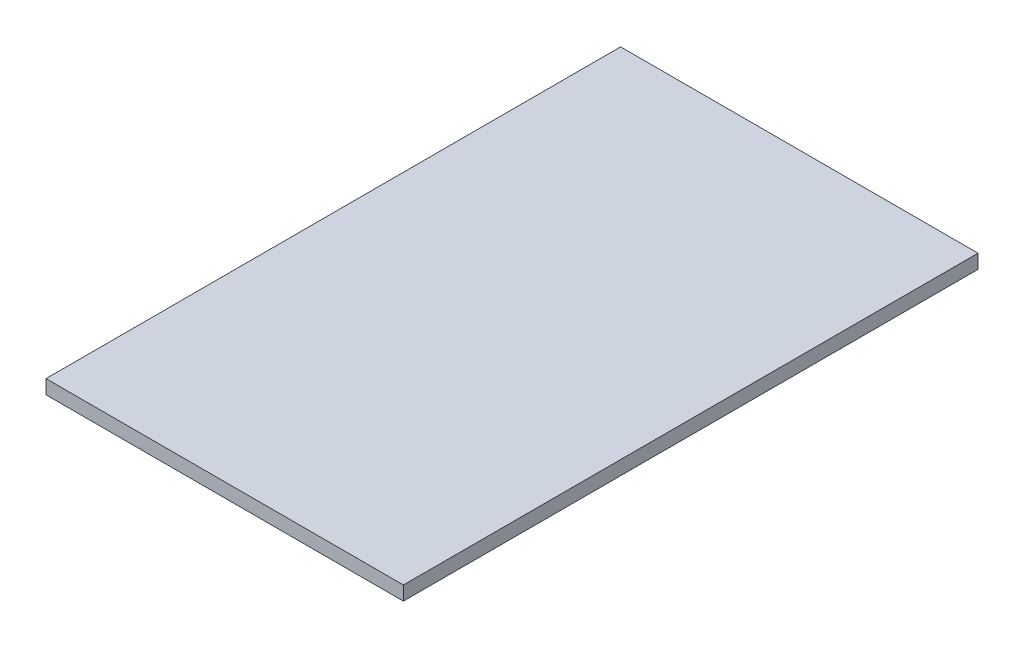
ISO-10303-21;
HEADER;
FILE_DESCRIPTION(('STEP AP214'),'2;1');
FILE_NAME('part.step','',(''),(''),'','','');
FILE_SCHEMA(('AUTOMOTIVE_DESIGN { 1 0 10303 214 1 1 1 1 }'));
ENDSEC;
DATA;
#1=APPLICATION_CONTEXT('core data for automotive mechanical design processes');
#2=APPLICATION_PROTOCOL_DEFINITION('international standard','automotive_design',2000,#1);
#3=PRODUCT_CONTEXT('',#1,'mechanical');
#4=PRODUCT('Part','Part','',(#3));
#5=PRODUCT_RELATED_PRODUCT_CATEGORY('part','',(#4));
#6=PRODUCT_DEFINITION_FORMATION('','',#4);
#7=PRODUCT_DEFINITION_CONTEXT('part definition',#1,'design');
#8=PRODUCT_DEFINITION('design','',#6,#7);
#9=PRODUCT_DEFINITION_SHAPE('','',#8);
#10=(LENGTH_UNIT() NAMED_UNIT(*) SI_UNIT(.MILLI.,.METRE.));
#11=(NAMED_UNIT(*) PLANE_ANGLE_UNIT() SI_UNIT($,.RADIAN.));
#12=(NAMED_UNIT(*) SI_UNIT($,.STERADIAN.) SOLID_ANGLE_UNIT());
#13=UNCERTAINTY_MEASURE_WITH_UNIT(LENGTH_MEASURE(1.E-05),#10,'distance_accuracy_value','');
#14=(GEOMETRIC_REPRESENTATION_CONTEXT(3) GLOBAL_UNCERTAINTY_ASSIGNED_CONTEXT((#13)) GLOBAL_UNIT_ASSIGNED_CONTEXT((#10,
#11,#12)) REPRESENTATION_CONTEXT('',''));
#15=CARTESIAN_POINT('',(0.,0.,0.));
#16=DIRECTION('',(0.,0.,1.));
#17=DIRECTION('',(1.,0.,0.));
#18=AXIS2_PLACEMENT_3D('',#15,#16,#17);
#19=CARTESIAN_POINT('',(127.5,-10.,205.));
#20=DIRECTION('',(1.,0.,0.));
#21=DIRECTION('',(0.,0.,-1.));
#22=AXIS2_PLACEMENT_3D('',#19,#20,#21);
#23=PLANE('',#22);
#24=DIRECTION('',(0.,0.,-1.));
#25=VECTOR('',#24,1.);
#26=CARTESIAN_POINT('',(127.5,0.,205.));
#27=LINE('',#26,#25);
#28=CARTESIAN_POINT('',(127.5,0.,205.));
#29=VERTEX_POINT('',#28);
#30=CARTESIAN_POINT('',(127.5,0.,-205.));
#31=VERTEX_POINT('',#30);
#32=EDGE_CURVE('E101',#29,#31,#27,.T.);
#33=ORIENTED_EDGE('',*,*,#32,.F.);
#34=DIRECTION('',(0.,1.,0.));
#35=VECTOR('',#34,1.);
#36=CARTESIAN_POINT('',(127.5,-10.,205.));
#37=LINE('',#36,#35);
#38=CARTESIAN_POINT('',(127.5,-10.,205.));
#39=VERTEX_POINT('',#38);
#40=EDGE_CURVE('E11',#39,#29,#37,.T.);
#41=ORIENTED_EDGE('',*,*,#40,.F.);
#42=DIRECTION('',(0.,0.,-1.));
#43=VECTOR('',#42,1.);
#44=CARTESIAN_POINT('',(127.5,-10.,205.));
#45=LINE('',#44,#43);
#46=CARTESIAN_POINT('',(127.5,-10.,-205.));
#47=VERTEX_POINT('',#46);
#48=EDGE_CURVE('E95',#39,#47,#45,.T.);
#49=ORIENTED_EDGE('',*,*,#48,.T.);
#50=DIRECTION('',(0.,1.,0.));
#51=VECTOR('',#50,1.);
#52=CARTESIAN_POINT('',(127.5,-10.,-205.));
#53=LINE('',#52,#51);
#54=EDGE_CURVE('E40',#47,#31,#53,.T.);
#55=ORIENTED_EDGE('',*,*,#54,.T.);
#56=EDGE_LOOP('',(#33,#41,#49,#55));
#57=FACE_BOUND('',#56,.T.);
#58=ADVANCED_FACE('F37',(#57),#23,.T.);
#59=CARTESIAN_POINT('',(-127.5,-10.,205.));
#60=DIRECTION('',(0.,0.,1.));
#61=DIRECTION('',(1.,0.,0.));
#62=AXIS2_PLACEMENT_3D('',#59,#60,#61);
#63=PLANE('',#62);
#64=DIRECTION('',(1.,0.,0.));
#65=VECTOR('',#64,1.);
#66=CARTESIAN_POINT('',(-127.5,0.,205.));
#67=LINE('',#66,#65);
#68=CARTESIAN_POINT('',(-127.5,0.,205.));
#69=VERTEX_POINT('',#68);
#70=EDGE_CURVE('E97',#69,#29,#67,.T.);
#71=ORIENTED_EDGE('',*,*,#70,.F.);
#72=DIRECTION('',(0.,1.,0.));
#73=VECTOR('',#72,1.);
#74=CARTESIAN_POINT('',(-127.5,-10.,205.));
#75=LINE('',#74,#73);
#76=CARTESIAN_POINT('',(-127.5,-10.,205.));
#77=VERTEX_POINT('',#76);
#78=EDGE_CURVE('E46',#77,#69,#75,.T.);
#79=ORIENTED_EDGE('',*,*,#78,.F.);
#80=DIRECTION('',(1.,0.,0.));
#81=VECTOR('',#80,1.);
#82=CARTESIAN_POINT('',(-127.5,-10.,205.));
#83=LINE('',#82,#81);
#84=EDGE_CURVE('E92',#77,#39,#83,.T.);
#85=ORIENTED_EDGE('',*,*,#84,.T.);
#86=ORIENTED_EDGE('',*,*,#40,.T.);
#87=EDGE_LOOP('',(#71,#79,#85,#86));
#88=FACE_BOUND('',#87,.T.);
#89=ADVANCED_FACE('F111',(#88),#63,.T.);
#90=CARTESIAN_POINT('',(-127.5,-10.,205.));
#91=DIRECTION('',(-1.,0.,0.));
#92=DIRECTION('',(0.,0.,1.));
#93=AXIS2_PLACEMENT_3D('',#90,#91,#92);
#94=PLANE('',#93);
#95=DIRECTION('',(0.,0.,1.));
#96=VECTOR('',#95,1.);
#97=CARTESIAN_POINT('',(-127.5,0.,205.));
#98=LINE('',#97,#96);
#99=CARTESIAN_POINT('',(-127.5,0.,-205.));
#100=VERTEX_POINT('',#99);
#101=EDGE_CURVE('E87',#100,#69,#98,.T.);
#102=ORIENTED_EDGE('',*,*,#101,.F.);
#103=DIRECTION('',(0.,1.,0.));
#104=VECTOR('',#103,1.);
#105=CARTESIAN_POINT('',(-127.5,-10.,-205.));
#106=LINE('',#105,#104);
#107=CARTESIAN_POINT('',(-127.5,-10.,-205.));
#108=VERTEX_POINT('',#107);
#109=EDGE_CURVE('E82',#108,#100,#106,.T.);
#110=ORIENTED_EDGE('',*,*,#109,.F.);
#111=DIRECTION('',(0.,0.,1.));
#112=VECTOR('',#111,1.);
#113=CARTESIAN_POINT('',(-127.5,-10.,205.));
#114=LINE('',#113,#112);
#115=EDGE_CURVE('E85',#108,#77,#114,.T.);
#116=ORIENTED_EDGE('',*,*,#115,.T.);
#117=ORIENTED_EDGE('',*,*,#78,.T.);
#118=EDGE_LOOP('',(#102,#110,#116,#117));
#119=FACE_BOUND('',#118,.T.);
#120=ADVANCED_FACE('F84',(#119),#94,.T.);
#121=CARTESIAN_POINT('',(-127.5,-10.,-205.));
#122=DIRECTION('',(0.,0.,-1.));
#123=DIRECTION('',(-1.,0.,0.));
#124=AXIS2_PLACEMENT_3D('',#121,#122,#123);
#125=PLANE('',#124);
#126=DIRECTION('',(-1.,0.,0.));
#127=VECTOR('',#126,1.);
#128=CARTESIAN_POINT('',(-127.5,0.,-205.));
#129=LINE('',#128,#127);
#130=EDGE_CURVE('E104',#31,#100,#129,.T.);
#131=ORIENTED_EDGE('',*,*,#130,.F.);
#132=ORIENTED_EDGE('',*,*,#54,.F.);
#133=DIRECTION('',(-1.,0.,0.));
#134=VECTOR('',#133,1.);
#135=CARTESIAN_POINT('',(-127.5,-10.,-205.));
#136=LINE('',#135,#134);
#137=EDGE_CURVE('E91',#47,#108,#136,.T.);
#138=ORIENTED_EDGE('',*,*,#137,.T.);
#139=ORIENTED_EDGE('',*,*,#109,.T.);
#140=EDGE_LOOP('',(#131,#132,#138,#139));
#141=FACE_BOUND('',#140,.T.);
#142=ADVANCED_FACE('F94',(#141),#125,.T.);
#143=CARTESIAN_POINT('',(0.,-10.,0.));
#144=DIRECTION('',(0.,-1.,0.));
#145=DIRECTION('',(0.,0.,-1.));
#146=AXIS2_PLACEMENT_3D('',#143,#144,#145);
#147=PLANE('',#146);
#148=ORIENTED_EDGE('',*,*,#48,.F.);
#149=ORIENTED_EDGE('',*,*,#84,.F.);
#150=ORIENTED_EDGE('',*,*,#115,.F.);
#151=ORIENTED_EDGE('',*,*,#137,.F.);
#152=EDGE_LOOP('',(#148,#149,#150,#151));
#153=FACE_BOUND('',#152,.T.);
#154=ADVANCED_FACE('F90',(#153),#147,.T.);
#155=CARTESIAN_POINT('',(0.,0.,0.));
#156=DIRECTION('',(0.,-1.,0.));
#157=DIRECTION('',(0.,0.,-1.));
#158=AXIS2_PLACEMENT_3D('',#155,#156,#157);
#159=PLANE('',#158);
#160=ORIENTED_EDGE('',*,*,#32,.T.);
#161=ORIENTED_EDGE('',*,*,#130,.T.);
#162=ORIENTED_EDGE('',*,*,#101,.T.);
#163=ORIENTED_EDGE('',*,*,#70,.T.);
#164=EDGE_LOOP('',(#160,#161,#162,#163));
#165=FACE_BOUND('',#164,.T.);
#166=ADVANCED_FACE('F110',(#165),#159,.F.);
#167=CLOSED_SHELL('',(#58,#89,#120,#142,#154,#166));
#168=MANIFOLD_SOLID_BREP('B2',#167);
#169=ADVANCED_BREP_SHAPE_REPRESENTATION('',(#18,#168),#14);
#170=SHAPE_DEFINITION_REPRESENTATION(#9,#169);
ENDSEC;
END-ISO-10303-21;
